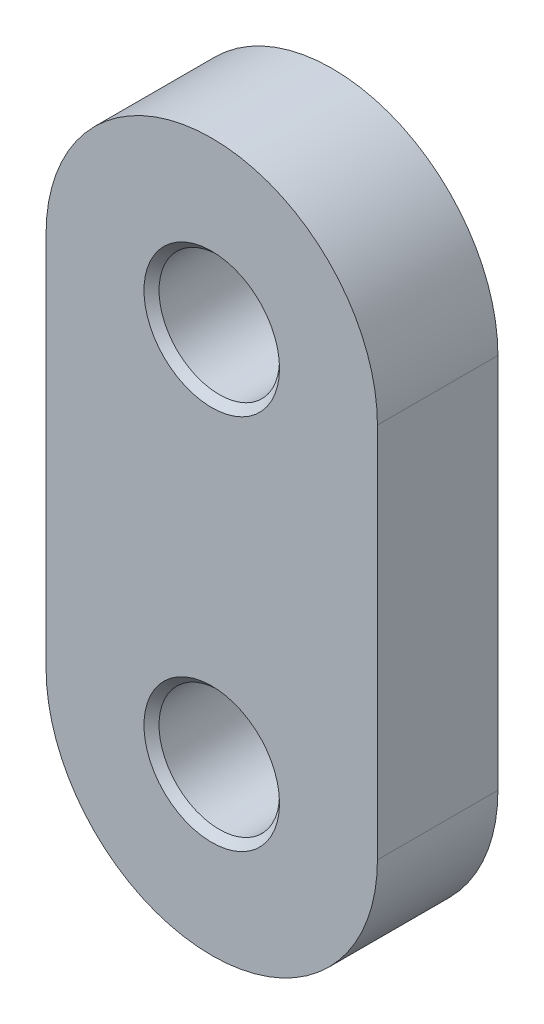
from build123d import *

# Parameters (mm, degrees)
BASE_EXTRUSION_DEPTH    = 8
ESQUISSE2_R             = 4
ENL_V_MAT_EXTRU_1_DEPTH = 39.48376281
ESQUISSE3_R             = 4
ENL_V_MAT_EXTRU_2_DEPTH = 37.545825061
CHANFREIN1_SIZE         = 0.5


with BuildPart() as part:
    # Esquisse1 → Base-Extrusion (new body)
    with BuildSketch(Plane.XY):
        with BuildLine():
            Line((-11, 0), (-11, -25))
            ThreePointArc((-11, -25), (0, -36), (11, -25))
            Line((11, -25), (11, 0))
            ThreePointArc((11, 0), (0, 11), (-11, 0))
        make_face()
    extrude(amount=BASE_EXTRUSION_DEPTH)

    # Esquisse2 → Enl_v. mat.-Extru.1 (cut, through all)
    with BuildSketch(Plane.XY.offset(8)):
        Circle(ESQUISSE2_R)
    extrude(amount=-ENL_V_MAT_EXTRU_1_DEPTH, mode=Mode.SUBTRACT)

    # Esquisse3 → Enl_v. mat.-Extru.2 (cut, through all)
    with BuildSketch(Plane(origin=(-1.490572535, -22.400343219, 8), x_dir=(1, 0, 0), z_dir=(0, 0, 1))):
        with Locations((1.490572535, -2.599656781)):
            Circle(ESQUISSE3_R)
    extrude(amount=-ENL_V_MAT_EXTRU_2_DEPTH, mode=Mode.SUBTRACT)

    # Chanfrein1
    chanfrein1_edges = [part.edges().sort_by_distance(p)[0] for p in [
        (-4, 0, 0),
        (-4, 0, 8),
        (-4, -25, 0),
        (-4, -25, 8),
    ]]
    chamfer(chanfrein1_edges, length=CHANFREIN1_SIZE)


solid = part.part
